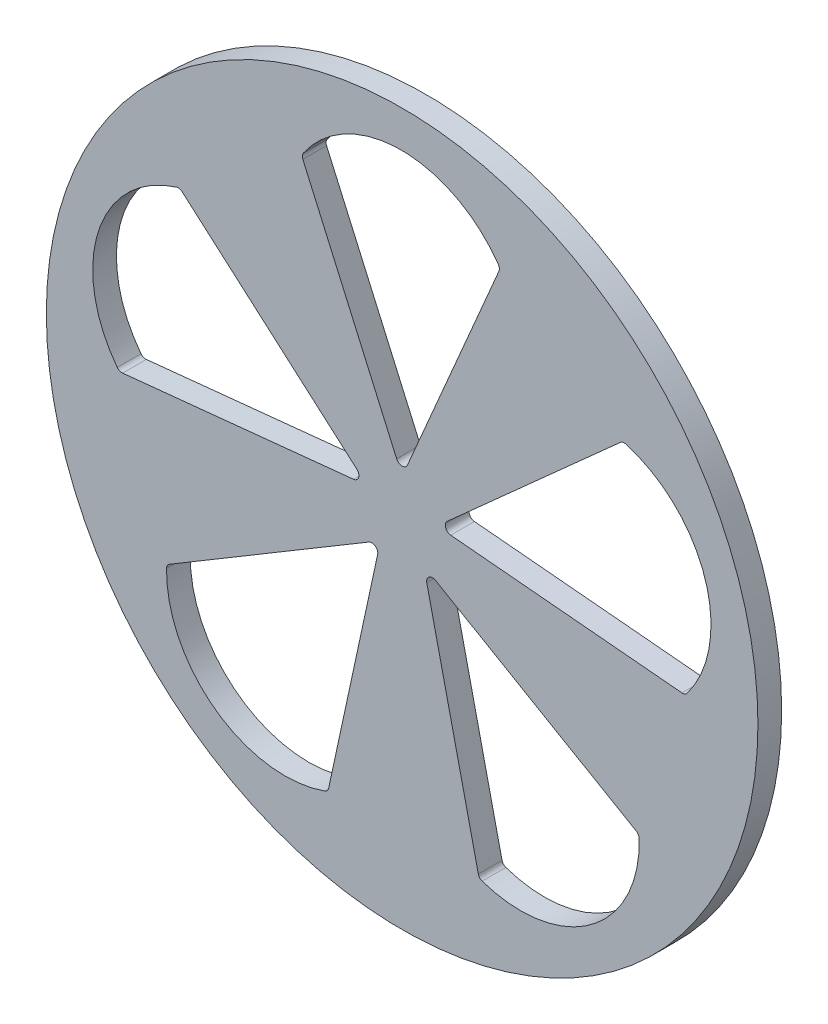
from build123d import *

# Parameters (mm, degrees)
ESQUISSE1_R        = 30
BOSS_EXTRU_1_DEPTH = 2
CONG_1_R           = 0.5


with BuildPart() as part:
    # Esquisse1 → Boss.-Extru.1 (new body)
    with BuildSketch(Plane.XY):
        Circle(ESQUISSE1_R)
        with BuildLine():
            Line((0, 3.101464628), (8.266251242, 22.406103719))
            ThreePointArc((8.266251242, 22.406103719), (-0.132620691, 26.89303802), (-8.480949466, 22.312750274))
            Line((-8.480949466, 22.312750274), (0, 3.101464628))
        make_face(mode=Mode.SUBTRACT)
        with BuildLine():
            Line((18.599929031, 14.96088128), (2.949668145, 0.958405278))
            Line((2.949668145, 0.958405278), (23.86388306, -0.937805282))
            ThreePointArc((23.86388306, -0.937805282), (25.535817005, 8.436535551), (18.599929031, 14.96088128))
        make_face(mode=Mode.SUBTRACT)
        with BuildLine():
            Line((19.976337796, -13.066417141), (1.822995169, -2.509137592))
            Line((1.822995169, -2.509137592), (6.482439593, -22.985699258))
            ThreePointArc((6.482439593, -22.985699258), (15.914623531, -21.678972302), (19.976337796, -13.066417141))
        make_face(mode=Mode.SUBTRACT)
        with BuildLine():
            Line((-6.253873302, -23.036371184), (-1.822995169, -2.509137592))
            Line((-1.822995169, -2.509137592), (-19.857515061, -13.268138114))
            ThreePointArc((-19.857515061, -13.268138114), (-15.700038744, -21.834877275), (-6.253873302, -23.036371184))
        make_face(mode=Mode.SUBTRACT)
        with BuildLine():
            Line((-23.841444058, -1.170843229), (-2.949668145, 0.958405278))
            Line((-2.949668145, 0.958405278), (-18.755058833, 14.785538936))
            ThreePointArc((-18.755058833, 14.785538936), (-25.617781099, 8.184276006), (-23.841444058, -1.170843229))
        make_face(mode=Mode.SUBTRACT)
    extrude(amount=BOSS_EXTRU_1_DEPTH)

    # Cong_1
    cong_1_edges = [part.edges().sort_by_distance(p)[0] for p in [
        (2.949668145, 0.958405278, 1),
        (23.86388306, -0.937805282, 1),
        (18.599929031, 14.96088128, 1),
        (1.822995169, -2.509137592, 1),
        (6.482439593, -22.985699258, 1),
        (19.976337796, -13.066417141, 1),
        (-1.822995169, -2.509137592, 1),
        (-19.857515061, -13.268138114, 1),
        (-6.253873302, -23.036371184, 1),
        (-2.949668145, 0.958405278, 1),
        (-18.755058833, 14.785538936, 1),
        (-23.841444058, -1.170843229, 1),
        (-8.480949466, 22.312750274, 1),
        (0, 3.101464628, 1),
        (8.266251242, 22.406103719, 1),
    ]]
    fillet(cong_1_edges, radius=CONG_1_R)


solid = part.part
